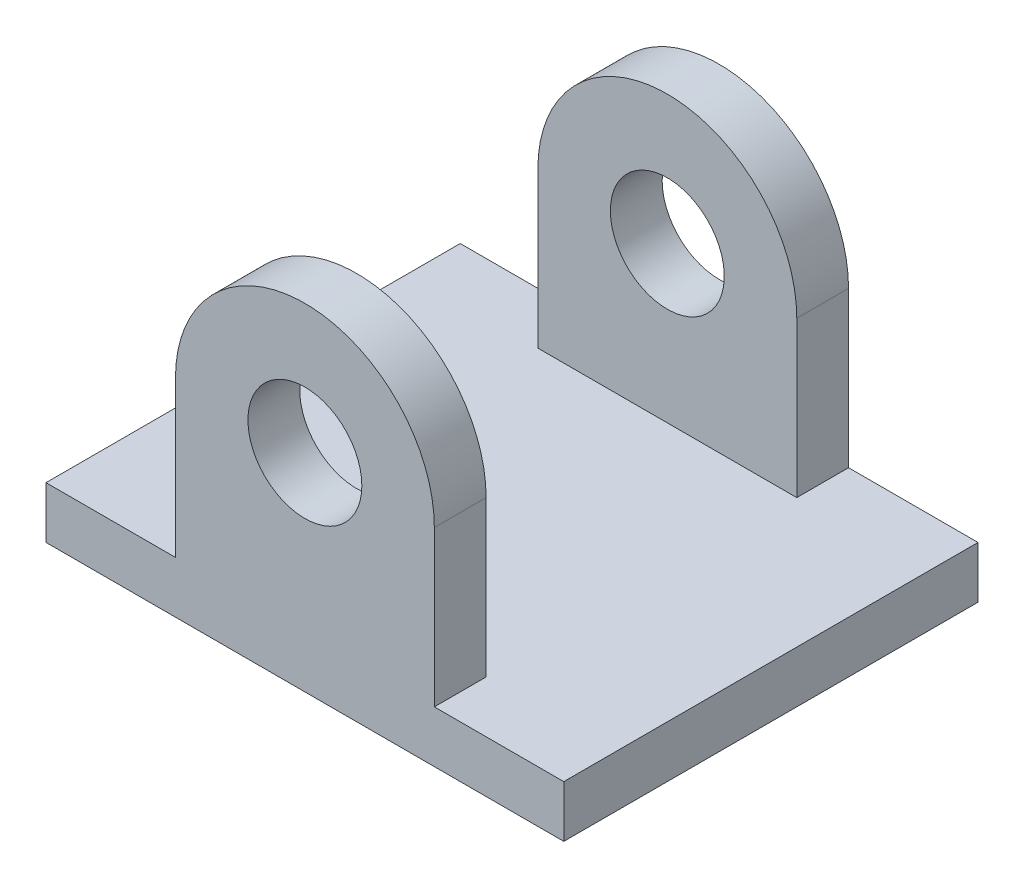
ISO-10303-21;
HEADER;
FILE_DESCRIPTION(('STEP AP214'),'2;1');
FILE_NAME('part.step','',(''),(''),'','','');
FILE_SCHEMA(('AUTOMOTIVE_DESIGN { 1 0 10303 214 1 1 1 1 }'));
ENDSEC;
DATA;
#1=APPLICATION_CONTEXT('core data for automotive mechanical design processes');
#2=APPLICATION_PROTOCOL_DEFINITION('international standard','automotive_design',2000,#1);
#3=PRODUCT_CONTEXT('',#1,'mechanical');
#4=PRODUCT('Part','Part','',(#3));
#5=PRODUCT_RELATED_PRODUCT_CATEGORY('part','',(#4));
#6=PRODUCT_DEFINITION_FORMATION('','',#4);
#7=PRODUCT_DEFINITION_CONTEXT('part definition',#1,'design');
#8=PRODUCT_DEFINITION('design','',#6,#7);
#9=PRODUCT_DEFINITION_SHAPE('','',#8);
#10=(LENGTH_UNIT() NAMED_UNIT(*) SI_UNIT(.MILLI.,.METRE.));
#11=(NAMED_UNIT(*) PLANE_ANGLE_UNIT() SI_UNIT($,.RADIAN.));
#12=(NAMED_UNIT(*) SI_UNIT($,.STERADIAN.) SOLID_ANGLE_UNIT());
#13=UNCERTAINTY_MEASURE_WITH_UNIT(LENGTH_MEASURE(1.E-05),#10,'distance_accuracy_value','');
#14=(GEOMETRIC_REPRESENTATION_CONTEXT(3) GLOBAL_UNCERTAINTY_ASSIGNED_CONTEXT((#13)) GLOBAL_UNIT_ASSIGNED_CONTEXT((#10,
#11,#12)) REPRESENTATION_CONTEXT('',''));
#15=CARTESIAN_POINT('',(0.,0.,0.));
#16=DIRECTION('',(0.,0.,1.));
#17=DIRECTION('',(1.,0.,0.));
#18=AXIS2_PLACEMENT_3D('',#15,#16,#17);
#19=CARTESIAN_POINT('',(25.,5.,-20.));
#20=DIRECTION('',(-1.,0.,0.));
#21=DIRECTION('',(0.,0.,1.));
#22=AXIS2_PLACEMENT_3D('',#19,#20,#21);
#23=PLANE('',#22);
#24=DIRECTION('',(0.,0.,-1.));
#25=VECTOR('',#24,1.);
#26=CARTESIAN_POINT('',(25.,0.,-20.));
#27=LINE('',#26,#25);
#28=CARTESIAN_POINT('',(25.,0.,20.));
#29=VERTEX_POINT('',#28);
#30=CARTESIAN_POINT('',(25.,0.,-20.));
#31=VERTEX_POINT('',#30);
#32=EDGE_CURVE('E185',#29,#31,#27,.T.);
#33=ORIENTED_EDGE('',*,*,#32,.T.);
#34=DIRECTION('',(0.,-1.,0.));
#35=VECTOR('',#34,1.);
#36=CARTESIAN_POINT('',(25.,5.,-20.));
#37=LINE('',#36,#35);
#38=CARTESIAN_POINT('',(25.,5.,-20.));
#39=VERTEX_POINT('',#38);
#40=EDGE_CURVE('E11',#39,#31,#37,.T.);
#41=ORIENTED_EDGE('',*,*,#40,.F.);
#42=DIRECTION('',(0.,0.,-1.));
#43=VECTOR('',#42,1.);
#44=CARTESIAN_POINT('',(25.,5.,-20.));
#45=LINE('',#44,#43);
#46=CARTESIAN_POINT('',(25.,5.,20.));
#47=VERTEX_POINT('',#46);
#48=EDGE_CURVE('E192',#47,#39,#45,.T.);
#49=ORIENTED_EDGE('',*,*,#48,.F.);
#50=DIRECTION('',(0.,-1.,0.));
#51=VECTOR('',#50,1.);
#52=CARTESIAN_POINT('',(25.,5.,20.));
#53=LINE('',#52,#51);
#54=EDGE_CURVE('E205',#47,#29,#53,.T.);
#55=ORIENTED_EDGE('',*,*,#54,.T.);
#56=EDGE_LOOP('',(#33,#41,#49,#55));
#57=FACE_BOUND('',#56,.T.);
#58=ADVANCED_FACE('F34',(#57),#23,.F.);
#59=CARTESIAN_POINT('',(-25.,5.,-20.));
#60=DIRECTION('',(0.,0.,1.));
#61=DIRECTION('',(1.,0.,0.));
#62=AXIS2_PLACEMENT_3D('',#59,#60,#61);
#63=PLANE('',#62);
#64=CARTESIAN_POINT('',(0.,20.,-20.));
#65=DIRECTION('',(0.,0.,-1.));
#66=DIRECTION('',(-1.,0.,0.));
#67=AXIS2_PLACEMENT_3D('',#64,#65,#66);
#68=CIRCLE('',#67,5.49999999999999);
#69=CARTESIAN_POINT('',(-5.49999999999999,20.,-20.));
#70=VERTEX_POINT('',#69);
#71=EDGE_CURVE('E349',#70,#70,#68,.T.);
#72=ORIENTED_EDGE('',*,*,#71,.F.);
#73=EDGE_LOOP('',(#72));
#74=FACE_BOUND('',#73,.T.);
#75=DIRECTION('',(-1.,0.,0.));
#76=VECTOR('',#75,1.);
#77=CARTESIAN_POINT('',(-25.,0.,-20.));
#78=LINE('',#77,#76);
#79=CARTESIAN_POINT('',(-25.,0.,-20.));
#80=VERTEX_POINT('',#79);
#81=EDGE_CURVE('E208',#31,#80,#78,.T.);
#82=ORIENTED_EDGE('',*,*,#81,.T.);
#83=DIRECTION('',(0.,-1.,0.));
#84=VECTOR('',#83,1.);
#85=CARTESIAN_POINT('',(-25.,5.,-20.));
#86=LINE('',#85,#84);
#87=CARTESIAN_POINT('',(-25.,5.,-20.));
#88=VERTEX_POINT('',#87);
#89=EDGE_CURVE('E42',#88,#80,#86,.T.);
#90=ORIENTED_EDGE('',*,*,#89,.F.);
#91=DIRECTION('',(-1.,0.,0.));
#92=VECTOR('',#91,1.);
#93=CARTESIAN_POINT('',(-25.,5.,-20.));
#94=LINE('',#93,#92);
#95=CARTESIAN_POINT('',(-12.5,5.,-20.));
#96=VERTEX_POINT('',#95);
#97=EDGE_CURVE('E195',#96,#88,#94,.T.);
#98=ORIENTED_EDGE('',*,*,#97,.F.);
#99=DIRECTION('',(0.,1.,0.));
#100=VECTOR('',#99,1.);
#101=CARTESIAN_POINT('',(-12.5,0.,-20.));
#102=LINE('',#101,#100);
#103=CARTESIAN_POINT('',(-12.5,20.,-20.));
#104=VERTEX_POINT('',#103);
#105=EDGE_CURVE('E143',#96,#104,#102,.T.);
#106=ORIENTED_EDGE('',*,*,#105,.T.);
#107=CARTESIAN_POINT('',(0.,20.,-20.));
#108=DIRECTION('',(0.,0.,1.));
#109=DIRECTION('',(1.,0.,0.));
#110=AXIS2_PLACEMENT_3D('',#107,#108,#109);
#111=CIRCLE('',#110,12.5);
#112=CARTESIAN_POINT('',(12.5,20.,-20.));
#113=VERTEX_POINT('',#112);
#114=EDGE_CURVE('E153',#113,#104,#111,.T.);
#115=ORIENTED_EDGE('',*,*,#114,.F.);
#116=DIRECTION('',(0.,1.,0.));
#117=VECTOR('',#116,1.);
#118=CARTESIAN_POINT('',(12.5,0.,-20.));
#119=LINE('',#118,#117);
#120=CARTESIAN_POINT('',(12.5,5.,-20.));
#121=VERTEX_POINT('',#120);
#122=EDGE_CURVE('E134',#121,#113,#119,.T.);
#123=ORIENTED_EDGE('',*,*,#122,.F.);
#124=EDGE_CURVE('E197',#39,#121,#94,.T.);
#125=ORIENTED_EDGE('',*,*,#124,.F.);
#126=ORIENTED_EDGE('',*,*,#40,.T.);
#127=EDGE_LOOP('',(#82,#90,#98,#106,#115,#123,#125,#126));
#128=FACE_BOUND('',#127,.T.);
#129=ADVANCED_FACE('F254',(#74,#128),#63,.F.);
#130=CARTESIAN_POINT('',(-25.,5.,-20.));
#131=DIRECTION('',(1.,0.,0.));
#132=DIRECTION('',(0.,0.,-1.));
#133=AXIS2_PLACEMENT_3D('',#130,#131,#132);
#134=PLANE('',#133);
#135=DIRECTION('',(0.,0.,1.));
#136=VECTOR('',#135,1.);
#137=CARTESIAN_POINT('',(-25.,0.,-20.));
#138=LINE('',#137,#136);
#139=CARTESIAN_POINT('',(-25.,0.,20.));
#140=VERTEX_POINT('',#139);
#141=EDGE_CURVE('E210',#80,#140,#138,.T.);
#142=ORIENTED_EDGE('',*,*,#141,.T.);
#143=DIRECTION('',(0.,-1.,0.));
#144=VECTOR('',#143,1.);
#145=CARTESIAN_POINT('',(-25.,5.,20.));
#146=LINE('',#145,#144);
#147=CARTESIAN_POINT('',(-25.,5.,20.));
#148=VERTEX_POINT('',#147);
#149=EDGE_CURVE('E215',#148,#140,#146,.T.);
#150=ORIENTED_EDGE('',*,*,#149,.F.);
#151=DIRECTION('',(0.,0.,1.));
#152=VECTOR('',#151,1.);
#153=CARTESIAN_POINT('',(-25.,5.,-20.));
#154=LINE('',#153,#152);
#155=EDGE_CURVE('E199',#88,#148,#154,.T.);
#156=ORIENTED_EDGE('',*,*,#155,.F.);
#157=ORIENTED_EDGE('',*,*,#89,.T.);
#158=EDGE_LOOP('',(#142,#150,#156,#157));
#159=FACE_BOUND('',#158,.T.);
#160=ADVANCED_FACE('F223',(#159),#134,.F.);
#161=CARTESIAN_POINT('',(-25.,5.,20.));
#162=DIRECTION('',(0.,0.,-1.));
#163=DIRECTION('',(-1.,0.,0.));
#164=AXIS2_PLACEMENT_3D('',#161,#162,#163);
#165=PLANE('',#164);
#166=CARTESIAN_POINT('',(0.,20.,20.));
#167=DIRECTION('',(0.,0.,1.));
#168=DIRECTION('',(1.,0.,0.));
#169=AXIS2_PLACEMENT_3D('',#166,#167,#168);
#170=CIRCLE('',#169,5.49999999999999);
#171=CARTESIAN_POINT('',(5.49999999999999,20.,20.));
#172=VERTEX_POINT('',#171);
#173=EDGE_CURVE('E157',#172,#172,#170,.T.);
#174=ORIENTED_EDGE('',*,*,#173,.F.);
#175=EDGE_LOOP('',(#174));
#176=FACE_BOUND('',#175,.T.);
#177=DIRECTION('',(1.,0.,0.));
#178=VECTOR('',#177,1.);
#179=CARTESIAN_POINT('',(-25.,0.,20.));
#180=LINE('',#179,#178);
#181=EDGE_CURVE('E196',#140,#29,#180,.T.);
#182=ORIENTED_EDGE('',*,*,#181,.T.);
#183=ORIENTED_EDGE('',*,*,#54,.F.);
#184=DIRECTION('',(1.,0.,0.));
#185=VECTOR('',#184,1.);
#186=CARTESIAN_POINT('',(-25.,5.,20.));
#187=LINE('',#186,#185);
#188=CARTESIAN_POINT('',(12.5,5.,20.));
#189=VERTEX_POINT('',#188);
#190=EDGE_CURVE('E201',#189,#47,#187,.T.);
#191=ORIENTED_EDGE('',*,*,#190,.F.);
#192=DIRECTION('',(0.,1.,0.));
#193=VECTOR('',#192,1.);
#194=CARTESIAN_POINT('',(12.5,0.,20.));
#195=LINE('',#194,#193);
#196=CARTESIAN_POINT('',(12.5,20.,20.));
#197=VERTEX_POINT('',#196);
#198=EDGE_CURVE('E167',#189,#197,#195,.T.);
#199=ORIENTED_EDGE('',*,*,#198,.T.);
#200=CARTESIAN_POINT('',(0.,20.,20.));
#201=DIRECTION('',(0.,0.,1.));
#202=DIRECTION('',(1.,0.,0.));
#203=AXIS2_PLACEMENT_3D('',#200,#201,#202);
#204=CIRCLE('',#203,12.5);
#205=CARTESIAN_POINT('',(-12.5,20.,20.));
#206=VERTEX_POINT('',#205);
#207=EDGE_CURVE('E175',#197,#206,#204,.T.);
#208=ORIENTED_EDGE('',*,*,#207,.T.);
#209=DIRECTION('',(0.,1.,0.));
#210=VECTOR('',#209,1.);
#211=CARTESIAN_POINT('',(-12.5,0.,20.));
#212=LINE('',#211,#210);
#213=CARTESIAN_POINT('',(-12.5,5.,20.));
#214=VERTEX_POINT('',#213);
#215=EDGE_CURVE('E178',#214,#206,#212,.T.);
#216=ORIENTED_EDGE('',*,*,#215,.F.);
#217=EDGE_CURVE('E202',#148,#214,#187,.T.);
#218=ORIENTED_EDGE('',*,*,#217,.F.);
#219=ORIENTED_EDGE('',*,*,#149,.T.);
#220=EDGE_LOOP('',(#182,#183,#191,#199,#208,#216,#218,#219));
#221=FACE_BOUND('',#220,.T.);
#222=ADVANCED_FACE('F232',(#176,#221),#165,.F.);
#223=CARTESIAN_POINT('',(0.,5.,0.));
#224=DIRECTION('',(0.,1.,0.));
#225=DIRECTION('',(0.,0.,1.));
#226=AXIS2_PLACEMENT_3D('',#223,#224,#225);
#227=PLANE('',#226);
#228=DIRECTION('',(0.,0.,-1.));
#229=VECTOR('',#228,1.);
#230=CARTESIAN_POINT('',(-12.5,5.,-15.));
#231=LINE('',#230,#229);
#232=CARTESIAN_POINT('',(-12.5,5.,-15.));
#233=VERTEX_POINT('',#232);
#234=EDGE_CURVE('E158',#233,#96,#231,.T.);
#235=ORIENTED_EDGE('',*,*,#234,.T.);
#236=ORIENTED_EDGE('',*,*,#97,.T.);
#237=ORIENTED_EDGE('',*,*,#155,.T.);
#238=ORIENTED_EDGE('',*,*,#217,.T.);
#239=DIRECTION('',(0.,0.,1.));
#240=VECTOR('',#239,1.);
#241=CARTESIAN_POINT('',(-12.5,5.,15.));
#242=LINE('',#241,#240);
#243=CARTESIAN_POINT('',(-12.5,5.,15.));
#244=VERTEX_POINT('',#243);
#245=EDGE_CURVE('E189',#244,#214,#242,.T.);
#246=ORIENTED_EDGE('',*,*,#245,.F.);
#247=DIRECTION('',(-1.,0.,0.));
#248=VECTOR('',#247,1.);
#249=CARTESIAN_POINT('',(0.,5.,15.));
#250=LINE('',#249,#248);
#251=CARTESIAN_POINT('',(12.5,5.,15.));
#252=VERTEX_POINT('',#251);
#253=EDGE_CURVE('E169',#252,#244,#250,.T.);
#254=ORIENTED_EDGE('',*,*,#253,.F.);
#255=DIRECTION('',(0.,0.,1.));
#256=VECTOR('',#255,1.);
#257=CARTESIAN_POINT('',(12.5,5.,15.));
#258=LINE('',#257,#256);
#259=EDGE_CURVE('E186',#252,#189,#258,.T.);
#260=ORIENTED_EDGE('',*,*,#259,.T.);
#261=ORIENTED_EDGE('',*,*,#190,.T.);
#262=ORIENTED_EDGE('',*,*,#48,.T.);
#263=ORIENTED_EDGE('',*,*,#124,.T.);
#264=DIRECTION('',(0.,0.,-1.));
#265=VECTOR('',#264,1.);
#266=CARTESIAN_POINT('',(12.5,5.,-15.));
#267=LINE('',#266,#265);
#268=CARTESIAN_POINT('',(12.5,5.,-15.));
#269=VERTEX_POINT('',#268);
#270=EDGE_CURVE('E54',#269,#121,#267,.T.);
#271=ORIENTED_EDGE('',*,*,#270,.F.);
#272=DIRECTION('',(-1.,0.,0.));
#273=VECTOR('',#272,1.);
#274=CARTESIAN_POINT('',(0.,5.,-15.));
#275=LINE('',#274,#273);
#276=EDGE_CURVE('E49',#269,#233,#275,.T.);
#277=ORIENTED_EDGE('',*,*,#276,.T.);
#278=EDGE_LOOP('',(#235,#236,#237,#238,#246,#254,#260,#261,#262,#263,#271,#277));
#279=FACE_BOUND('',#278,.T.);
#280=ADVANCED_FACE('F238',(#279),#227,.T.);
#281=CARTESIAN_POINT('',(0.,0.,0.));
#282=DIRECTION('',(0.,1.,0.));
#283=DIRECTION('',(0.,0.,1.));
#284=AXIS2_PLACEMENT_3D('',#281,#282,#283);
#285=PLANE('',#284);
#286=ORIENTED_EDGE('',*,*,#32,.F.);
#287=ORIENTED_EDGE('',*,*,#181,.F.);
#288=ORIENTED_EDGE('',*,*,#141,.F.);
#289=ORIENTED_EDGE('',*,*,#81,.F.);
#290=EDGE_LOOP('',(#286,#287,#288,#289));
#291=FACE_BOUND('',#290,.T.);
#292=ADVANCED_FACE('F229',(#291),#285,.F.);
#293=CARTESIAN_POINT('',(0.,20.,15.));
#294=DIRECTION('',(0.,0.,1.));
#295=DIRECTION('',(1.,0.,0.));
#296=AXIS2_PLACEMENT_3D('',#293,#294,#295);
#297=CYLINDRICAL_SURFACE('',#296,12.5);
#298=ORIENTED_EDGE('',*,*,#207,.F.);
#299=DIRECTION('',(0.,0.,1.));
#300=VECTOR('',#299,1.);
#301=CARTESIAN_POINT('',(12.5,20.,15.));
#302=LINE('',#301,#300);
#303=CARTESIAN_POINT('',(12.5,20.,15.));
#304=VERTEX_POINT('',#303);
#305=EDGE_CURVE('E183',#304,#197,#302,.T.);
#306=ORIENTED_EDGE('',*,*,#305,.F.);
#307=CARTESIAN_POINT('',(0.,20.,15.));
#308=DIRECTION('',(0.,0.,1.));
#309=DIRECTION('',(1.,0.,0.));
#310=AXIS2_PLACEMENT_3D('',#307,#308,#309);
#311=CIRCLE('',#310,12.5);
#312=CARTESIAN_POINT('',(-12.5,20.,15.));
#313=VERTEX_POINT('',#312);
#314=EDGE_CURVE('E163',#304,#313,#311,.T.);
#315=ORIENTED_EDGE('',*,*,#314,.T.);
#316=DIRECTION('',(0.,0.,1.));
#317=VECTOR('',#316,1.);
#318=CARTESIAN_POINT('',(-12.5,20.,15.));
#319=LINE('',#318,#317);
#320=EDGE_CURVE('E174',#313,#206,#319,.T.);
#321=ORIENTED_EDGE('',*,*,#320,.T.);
#322=EDGE_LOOP('',(#298,#306,#315,#321));
#323=FACE_BOUND('',#322,.T.);
#324=ADVANCED_FACE('F247',(#323),#297,.T.);
#325=CARTESIAN_POINT('',(12.5,0.,15.));
#326=DIRECTION('',(1.,0.,0.));
#327=DIRECTION('',(0.,0.,-1.));
#328=AXIS2_PLACEMENT_3D('',#325,#326,#327);
#329=PLANE('',#328);
#330=ORIENTED_EDGE('',*,*,#198,.F.);
#331=ORIENTED_EDGE('',*,*,#259,.F.);
#332=DIRECTION('',(0.,1.,0.));
#333=VECTOR('',#332,1.);
#334=CARTESIAN_POINT('',(12.5,0.,15.));
#335=LINE('',#334,#333);
#336=EDGE_CURVE('E171',#252,#304,#335,.T.);
#337=ORIENTED_EDGE('',*,*,#336,.T.);
#338=ORIENTED_EDGE('',*,*,#305,.T.);
#339=EDGE_LOOP('',(#330,#331,#337,#338));
#340=FACE_BOUND('',#339,.T.);
#341=ADVANCED_FACE('F243',(#340),#329,.T.);
#342=CARTESIAN_POINT('',(-12.5,0.,15.));
#343=DIRECTION('',(1.,0.,0.));
#344=DIRECTION('',(0.,1.,0.));
#345=AXIS2_PLACEMENT_3D('',#342,#343,#344);
#346=PLANE('',#345);
#347=ORIENTED_EDGE('',*,*,#215,.T.);
#348=ORIENTED_EDGE('',*,*,#320,.F.);
#349=DIRECTION('',(0.,1.,0.));
#350=VECTOR('',#349,1.);
#351=CARTESIAN_POINT('',(-12.5,0.,15.));
#352=LINE('',#351,#350);
#353=EDGE_CURVE('E166',#244,#313,#352,.T.);
#354=ORIENTED_EDGE('',*,*,#353,.F.);
#355=ORIENTED_EDGE('',*,*,#245,.T.);
#356=EDGE_LOOP('',(#347,#348,#354,#355));
#357=FACE_BOUND('',#356,.T.);
#358=ADVANCED_FACE('F251',(#357),#346,.F.);
#359=CARTESIAN_POINT('',(0.,0.,15.));
#360=DIRECTION('',(0.,0.,1.));
#361=DIRECTION('',(1.,0.,0.));
#362=AXIS2_PLACEMENT_3D('',#359,#360,#361);
#363=PLANE('',#362);
#364=CARTESIAN_POINT('',(0.,20.,15.));
#365=DIRECTION('',(0.,0.,1.));
#366=DIRECTION('',(1.,0.,0.));
#367=AXIS2_PLACEMENT_3D('',#364,#365,#366);
#368=CIRCLE('',#367,5.49999999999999);
#369=CARTESIAN_POINT('',(5.49999999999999,20.,15.));
#370=VERTEX_POINT('',#369);
#371=EDGE_CURVE('E37',#370,#370,#368,.T.);
#372=ORIENTED_EDGE('',*,*,#371,.T.);
#373=EDGE_LOOP('',(#372));
#374=FACE_BOUND('',#373,.T.);
#375=ORIENTED_EDGE('',*,*,#314,.F.);
#376=ORIENTED_EDGE('',*,*,#336,.F.);
#377=ORIENTED_EDGE('',*,*,#253,.T.);
#378=ORIENTED_EDGE('',*,*,#353,.T.);
#379=EDGE_LOOP('',(#375,#376,#377,#378));
#380=FACE_BOUND('',#379,.T.);
#381=ADVANCED_FACE('F289',(#374,#380),#363,.F.);
#382=CARTESIAN_POINT('',(0.,20.,20.));
#383=DIRECTION('',(0.,0.,1.));
#384=DIRECTION('',(1.,0.,0.));
#385=AXIS2_PLACEMENT_3D('',#382,#383,#384);
#386=CYLINDRICAL_SURFACE('',#385,5.49999999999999);
#387=ORIENTED_EDGE('',*,*,#173,.T.);
#388=EDGE_LOOP('',(#387));
#389=FACE_BOUND('',#388,.T.);
#390=ORIENTED_EDGE('',*,*,#371,.F.);
#391=EDGE_LOOP('',(#390));
#392=FACE_BOUND('',#391,.T.);
#393=ADVANCED_FACE('F264',(#389,#392),#386,.F.);
#394=CARTESIAN_POINT('',(0.,20.,-15.));
#395=DIRECTION('',(0.,0.,-1.));
#396=DIRECTION('',(-1.,0.,0.));
#397=AXIS2_PLACEMENT_3D('',#394,#395,#396);
#398=CYLINDRICAL_SURFACE('',#397,12.5);
#399=ORIENTED_EDGE('',*,*,#114,.T.);
#400=DIRECTION('',(0.,0.,-1.));
#401=VECTOR('',#400,1.);
#402=CARTESIAN_POINT('',(-12.5,20.,-15.));
#403=LINE('',#402,#401);
#404=CARTESIAN_POINT('',(-12.5,20.,-15.));
#405=VERTEX_POINT('',#404);
#406=EDGE_CURVE('E141',#405,#104,#403,.T.);
#407=ORIENTED_EDGE('',*,*,#406,.F.);
#408=CARTESIAN_POINT('',(0.,20.,-15.));
#409=DIRECTION('',(0.,0.,1.));
#410=DIRECTION('',(1.,0.,0.));
#411=AXIS2_PLACEMENT_3D('',#408,#409,#410);
#412=CIRCLE('',#411,12.5);
#413=CARTESIAN_POINT('',(12.5,20.,-15.));
#414=VERTEX_POINT('',#413);
#415=EDGE_CURVE('E126',#414,#405,#412,.T.);
#416=ORIENTED_EDGE('',*,*,#415,.F.);
#417=DIRECTION('',(0.,0.,-1.));
#418=VECTOR('',#417,1.);
#419=CARTESIAN_POINT('',(12.5,20.,-15.));
#420=LINE('',#419,#418);
#421=EDGE_CURVE('E131',#414,#113,#420,.T.);
#422=ORIENTED_EDGE('',*,*,#421,.T.);
#423=EDGE_LOOP('',(#399,#407,#416,#422));
#424=FACE_BOUND('',#423,.T.);
#425=ADVANCED_FACE('F140',(#424),#398,.T.);
#426=CARTESIAN_POINT('',(-12.5,0.,-15.));
#427=DIRECTION('',(-1.,0.,0.));
#428=DIRECTION('',(0.,-1.,0.));
#429=AXIS2_PLACEMENT_3D('',#426,#427,#428);
#430=PLANE('',#429);
#431=ORIENTED_EDGE('',*,*,#105,.F.);
#432=ORIENTED_EDGE('',*,*,#234,.F.);
#433=DIRECTION('',(0.,1.,0.));
#434=VECTOR('',#433,1.);
#435=CARTESIAN_POINT('',(-12.5,0.,-15.));
#436=LINE('',#435,#434);
#437=EDGE_CURVE('E138',#233,#405,#436,.T.);
#438=ORIENTED_EDGE('',*,*,#437,.T.);
#439=ORIENTED_EDGE('',*,*,#406,.T.);
#440=EDGE_LOOP('',(#431,#432,#438,#439));
#441=FACE_BOUND('',#440,.T.);
#442=ADVANCED_FACE('F256',(#441),#430,.T.);
#443=CARTESIAN_POINT('',(12.5,0.,-15.));
#444=DIRECTION('',(-1.,0.,0.));
#445=DIRECTION('',(0.,0.,1.));
#446=AXIS2_PLACEMENT_3D('',#443,#444,#445);
#447=PLANE('',#446);
#448=ORIENTED_EDGE('',*,*,#122,.T.);
#449=ORIENTED_EDGE('',*,*,#421,.F.);
#450=DIRECTION('',(0.,1.,0.));
#451=VECTOR('',#450,1.);
#452=CARTESIAN_POINT('',(12.5,0.,-15.));
#453=LINE('',#452,#451);
#454=EDGE_CURVE('E121',#269,#414,#453,.T.);
#455=ORIENTED_EDGE('',*,*,#454,.F.);
#456=ORIENTED_EDGE('',*,*,#270,.T.);
#457=EDGE_LOOP('',(#448,#449,#455,#456));
#458=FACE_BOUND('',#457,.T.);
#459=ADVANCED_FACE('F132',(#458),#447,.F.);
#460=CARTESIAN_POINT('',(0.,0.,-15.));
#461=DIRECTION('',(0.,0.,-1.));
#462=DIRECTION('',(1.,0.,0.));
#463=AXIS2_PLACEMENT_3D('',#460,#461,#462);
#464=PLANE('',#463);
#465=CARTESIAN_POINT('',(0.,20.,-15.));
#466=DIRECTION('',(0.,0.,-1.));
#467=DIRECTION('',(-1.,0.,0.));
#468=AXIS2_PLACEMENT_3D('',#465,#466,#467);
#469=CIRCLE('',#468,5.49999999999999);
#470=CARTESIAN_POINT('',(-5.49999999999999,20.,-15.));
#471=VERTEX_POINT('',#470);
#472=EDGE_CURVE('E148',#471,#471,#469,.T.);
#473=ORIENTED_EDGE('',*,*,#472,.T.);
#474=EDGE_LOOP('',(#473));
#475=FACE_BOUND('',#474,.T.);
#476=ORIENTED_EDGE('',*,*,#415,.T.);
#477=ORIENTED_EDGE('',*,*,#437,.F.);
#478=ORIENTED_EDGE('',*,*,#276,.F.);
#479=ORIENTED_EDGE('',*,*,#454,.T.);
#480=EDGE_LOOP('',(#476,#477,#478,#479));
#481=FACE_BOUND('',#480,.T.);
#482=ADVANCED_FACE('F123',(#475,#481),#464,.F.);
#483=CARTESIAN_POINT('',(0.,20.,-20.));
#484=DIRECTION('',(0.,0.,-1.));
#485=DIRECTION('',(-1.,0.,0.));
#486=AXIS2_PLACEMENT_3D('',#483,#484,#485);
#487=CYLINDRICAL_SURFACE('',#486,5.49999999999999);
#488=ORIENTED_EDGE('',*,*,#71,.T.);
#489=EDGE_LOOP('',(#488));
#490=FACE_BOUND('',#489,.T.);
#491=ORIENTED_EDGE('',*,*,#472,.F.);
#492=EDGE_LOOP('',(#491));
#493=FACE_BOUND('',#492,.T.);
#494=ADVANCED_FACE('F334',(#490,#493),#487,.F.);
#495=CLOSED_SHELL('',(#58,#129,#160,#222,#280,#292,#324,#341,#358,#381,#393,#425,#442,#459,#482,#494));
#496=MANIFOLD_SOLID_BREP('B2',#495);
#497=ADVANCED_BREP_SHAPE_REPRESENTATION('',(#18,#496),#14);
#498=SHAPE_DEFINITION_REPRESENTATION(#9,#497);
ENDSEC;
END-ISO-10303-21;
